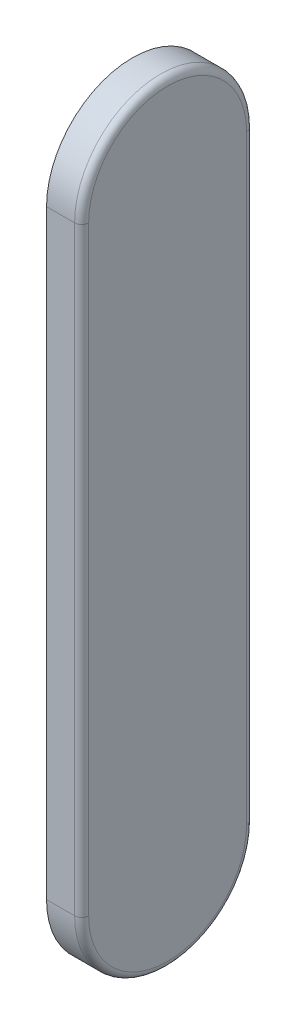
ISO-10303-21;
HEADER;
FILE_DESCRIPTION(('STEP AP214'),'2;1');
FILE_NAME('part.step','',(''),(''),'','','');
FILE_SCHEMA(('AUTOMOTIVE_DESIGN { 1 0 10303 214 1 1 1 1 }'));
ENDSEC;
DATA;
#1=APPLICATION_CONTEXT('core data for automotive mechanical design processes');
#2=APPLICATION_PROTOCOL_DEFINITION('international standard','automotive_design',2000,#1);
#3=PRODUCT_CONTEXT('',#1,'mechanical');
#4=PRODUCT('Part','Part','',(#3));
#5=PRODUCT_RELATED_PRODUCT_CATEGORY('part','',(#4));
#6=PRODUCT_DEFINITION_FORMATION('','',#4);
#7=PRODUCT_DEFINITION_CONTEXT('part definition',#1,'design');
#8=PRODUCT_DEFINITION('design','',#6,#7);
#9=PRODUCT_DEFINITION_SHAPE('','',#8);
#10=(LENGTH_UNIT() NAMED_UNIT(*) SI_UNIT(.MILLI.,.METRE.));
#11=(NAMED_UNIT(*) PLANE_ANGLE_UNIT() SI_UNIT($,.RADIAN.));
#12=(NAMED_UNIT(*) SI_UNIT($,.STERADIAN.) SOLID_ANGLE_UNIT());
#13=UNCERTAINTY_MEASURE_WITH_UNIT(LENGTH_MEASURE(1.E-05),#10,'distance_accuracy_value','');
#14=(GEOMETRIC_REPRESENTATION_CONTEXT(3) GLOBAL_UNCERTAINTY_ASSIGNED_CONTEXT((#13)) GLOBAL_UNIT_ASSIGNED_CONTEXT((#10,
#11,#12)) REPRESENTATION_CONTEXT('',''));
#15=CARTESIAN_POINT('',(0.,0.,0.));
#16=DIRECTION('',(0.,0.,1.));
#17=DIRECTION('',(1.,0.,0.));
#18=AXIS2_PLACEMENT_3D('',#15,#16,#17);
#19=CARTESIAN_POINT('',(39.25,23.825,3.99999999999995));
#20=DIRECTION('',(1.,0.,0.));
#21=DIRECTION('',(0.,0.,-1.));
#22=AXIS2_PLACEMENT_3D('',#19,#20,#21);
#23=PLANE('',#22);
#24=CARTESIAN_POINT('',(39.25,23.825,3.99999999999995));
#25=DIRECTION('',(-1.,0.,0.));
#26=DIRECTION('',(0.,0.,1.));
#27=AXIS2_PLACEMENT_3D('',#24,#25,#26);
#28=CIRCLE('',#27,1.125);
#29=CARTESIAN_POINT('',(39.25,23.825,5.12499999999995));
#30=VERTEX_POINT('',#29);
#31=CARTESIAN_POINT('',(39.25,23.825,2.87499999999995));
#32=VERTEX_POINT('',#31);
#33=EDGE_CURVE('E176',#30,#32,#28,.T.);
#34=ORIENTED_EDGE('',*,*,#33,.F.);
#35=DIRECTION('',(0.,1.,0.));
#36=VECTOR('',#35,1.);
#37=CARTESIAN_POINT('',(39.25,23.825,5.12499999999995));
#38=LINE('',#37,#36);
#39=CARTESIAN_POINT('',(39.25,15.275,5.12499999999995));
#40=VERTEX_POINT('',#39);
#41=EDGE_CURVE('E115',#40,#30,#38,.T.);
#42=ORIENTED_EDGE('',*,*,#41,.F.);
#43=CARTESIAN_POINT('',(39.25,15.275,3.99999999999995));
#44=DIRECTION('',(-1.,0.,0.));
#45=DIRECTION('',(0.,0.,-1.));
#46=AXIS2_PLACEMENT_3D('',#43,#44,#45);
#47=CIRCLE('',#46,1.125);
#48=CARTESIAN_POINT('',(39.25,15.275,2.87499999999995));
#49=VERTEX_POINT('',#48);
#50=EDGE_CURVE('E132',#49,#40,#47,.T.);
#51=ORIENTED_EDGE('',*,*,#50,.F.);
#52=DIRECTION('',(0.,-1.,0.));
#53=VECTOR('',#52,1.);
#54=CARTESIAN_POINT('',(39.25,23.825,2.87499999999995));
#55=LINE('',#54,#53);
#56=EDGE_CURVE('E154',#32,#49,#55,.T.);
#57=ORIENTED_EDGE('',*,*,#56,.F.);
#58=EDGE_LOOP('',(#34,#42,#51,#57));
#59=FACE_BOUND('',#58,.T.);
#60=ADVANCED_FACE('F17',(#59),#23,.T.);
#61=CARTESIAN_POINT('',(39.15,23.825,5.12499999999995));
#62=DIRECTION('',(0.,1.,0.));
#63=DIRECTION('',(0.,0.,1.));
#64=AXIS2_PLACEMENT_3D('',#61,#62,#63);
#65=CYLINDRICAL_SURFACE('',#64,0.1);
#66=CARTESIAN_POINT('',(39.15,15.275,5.12499999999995));
#67=DIRECTION('',(0.,-1.,0.));
#68=DIRECTION('',(0.,0.,1.));
#69=AXIS2_PLACEMENT_3D('',#66,#67,#68);
#70=CIRCLE('',#69,0.1);
#71=CARTESIAN_POINT('',(39.15,15.275,5.22499999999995));
#72=VERTEX_POINT('',#71);
#73=EDGE_CURVE('E123',#40,#72,#70,.T.);
#74=ORIENTED_EDGE('',*,*,#73,.F.);
#75=ORIENTED_EDGE('',*,*,#41,.T.);
#76=CARTESIAN_POINT('',(39.15,23.825,5.12499999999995));
#77=DIRECTION('',(0.,-1.,0.));
#78=DIRECTION('',(0.,0.,1.));
#79=AXIS2_PLACEMENT_3D('',#76,#77,#78);
#80=CIRCLE('',#79,0.1);
#81=CARTESIAN_POINT('',(39.15,23.825,5.22499999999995));
#82=VERTEX_POINT('',#81);
#83=EDGE_CURVE('E157',#82,#30,#80,.F.);
#84=ORIENTED_EDGE('',*,*,#83,.F.);
#85=DIRECTION('',(0.,1.,0.));
#86=VECTOR('',#85,1.);
#87=CARTESIAN_POINT('',(39.15,23.825,5.22499999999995));
#88=LINE('',#87,#86);
#89=EDGE_CURVE('E188',#82,#72,#88,.F.);
#90=ORIENTED_EDGE('',*,*,#89,.T.);
#91=EDGE_LOOP('',(#74,#75,#84,#90));
#92=FACE_BOUND('',#91,.T.);
#93=ADVANCED_FACE('F145',(#92),#65,.T.);
#94=CARTESIAN_POINT('',(39.15,15.275,3.99999999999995));
#95=DIRECTION('',(1.,0.,0.));
#96=DIRECTION('',(0.,0.,-1.));
#97=AXIS2_PLACEMENT_3D('',#94,#95,#96);
#98=TOROIDAL_SURFACE('',#97,1.125,0.1);
#99=CARTESIAN_POINT('',(39.15,15.275,2.87499999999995));
#100=DIRECTION('',(0.,-1.,0.));
#101=DIRECTION('',(0.,0.,-1.));
#102=AXIS2_PLACEMENT_3D('',#99,#100,#101);
#103=CIRCLE('',#102,0.0999999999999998);
#104=CARTESIAN_POINT('',(39.15,15.275,2.77499999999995));
#105=VERTEX_POINT('',#104);
#106=EDGE_CURVE('E158',#49,#105,#103,.F.);
#107=ORIENTED_EDGE('',*,*,#106,.F.);
#108=ORIENTED_EDGE('',*,*,#50,.T.);
#109=ORIENTED_EDGE('',*,*,#73,.T.);
#110=CARTESIAN_POINT('',(39.15,15.275,3.99999999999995));
#111=DIRECTION('',(-1.,0.,0.));
#112=DIRECTION('',(0.,0.,1.));
#113=AXIS2_PLACEMENT_3D('',#110,#111,#112);
#114=CIRCLE('',#113,1.225);
#115=EDGE_CURVE('E55',#105,#72,#114,.T.);
#116=ORIENTED_EDGE('',*,*,#115,.F.);
#117=EDGE_LOOP('',(#107,#108,#109,#116));
#118=FACE_BOUND('',#117,.T.);
#119=ADVANCED_FACE('F136',(#118),#98,.T.);
#120=CARTESIAN_POINT('',(39.15,23.825,2.87499999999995));
#121=DIRECTION('',(0.,-1.,0.));
#122=DIRECTION('',(0.,0.,-1.));
#123=AXIS2_PLACEMENT_3D('',#120,#121,#122);
#124=CYLINDRICAL_SURFACE('',#123,0.0999999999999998);
#125=CARTESIAN_POINT('',(39.15,23.825,2.87499999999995));
#126=DIRECTION('',(0.,1.,0.));
#127=DIRECTION('',(0.,0.,-1.));
#128=AXIS2_PLACEMENT_3D('',#125,#126,#127);
#129=CIRCLE('',#128,0.1);
#130=CARTESIAN_POINT('',(39.15,23.825,2.77499999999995));
#131=VERTEX_POINT('',#130);
#132=EDGE_CURVE('E96',#32,#131,#129,.T.);
#133=ORIENTED_EDGE('',*,*,#132,.F.);
#134=ORIENTED_EDGE('',*,*,#56,.T.);
#135=ORIENTED_EDGE('',*,*,#106,.T.);
#136=DIRECTION('',(0.,-1.,0.));
#137=VECTOR('',#136,1.);
#138=CARTESIAN_POINT('',(39.15,15.275,2.77499999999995));
#139=LINE('',#138,#137);
#140=EDGE_CURVE('E79',#105,#131,#139,.F.);
#141=ORIENTED_EDGE('',*,*,#140,.T.);
#142=EDGE_LOOP('',(#133,#134,#135,#141));
#143=FACE_BOUND('',#142,.T.);
#144=ADVANCED_FACE('F104',(#143),#124,.T.);
#145=CARTESIAN_POINT('',(39.15,23.825,3.99999999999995));
#146=DIRECTION('',(1.,0.,0.));
#147=DIRECTION('',(0.,0.,-1.));
#148=AXIS2_PLACEMENT_3D('',#145,#146,#147);
#149=TOROIDAL_SURFACE('',#148,1.125,0.1);
#150=ORIENTED_EDGE('',*,*,#132,.T.);
#151=CARTESIAN_POINT('',(39.15,23.825,3.99999999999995));
#152=DIRECTION('',(-1.,0.,0.));
#153=DIRECTION('',(0.,0.,1.));
#154=AXIS2_PLACEMENT_3D('',#151,#152,#153);
#155=CIRCLE('',#154,1.225);
#156=EDGE_CURVE('E72',#82,#131,#155,.T.);
#157=ORIENTED_EDGE('',*,*,#156,.F.);
#158=ORIENTED_EDGE('',*,*,#83,.T.);
#159=ORIENTED_EDGE('',*,*,#33,.T.);
#160=EDGE_LOOP('',(#150,#157,#158,#159));
#161=FACE_BOUND('',#160,.T.);
#162=ADVANCED_FACE('F99',(#161),#149,.T.);
#163=CARTESIAN_POINT('',(39.25,23.825,5.22499999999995));
#164=DIRECTION('',(0.,0.,-1.));
#165=DIRECTION('',(-1.,0.,0.));
#166=AXIS2_PLACEMENT_3D('',#163,#164,#165);
#167=PLANE('',#166);
#168=ORIENTED_EDGE('',*,*,#89,.F.);
#169=DIRECTION('',(-1.,0.,0.));
#170=VECTOR('',#169,1.);
#171=CARTESIAN_POINT('',(39.25,23.825,5.22499999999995));
#172=LINE('',#171,#170);
#173=CARTESIAN_POINT('',(38.75,23.825,5.22499999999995));
#174=VERTEX_POINT('',#173);
#175=EDGE_CURVE('E70',#174,#82,#172,.F.);
#176=ORIENTED_EDGE('',*,*,#175,.F.);
#177=DIRECTION('',(0.,1.,0.));
#178=VECTOR('',#177,1.);
#179=CARTESIAN_POINT('',(38.75,23.825,5.22499999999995));
#180=LINE('',#179,#178);
#181=CARTESIAN_POINT('',(38.75,15.275,5.22499999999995));
#182=VERTEX_POINT('',#181);
#183=EDGE_CURVE('E65',#174,#182,#180,.F.);
#184=ORIENTED_EDGE('',*,*,#183,.T.);
#185=DIRECTION('',(-1.,0.,0.));
#186=VECTOR('',#185,1.);
#187=CARTESIAN_POINT('',(39.25,15.275,5.22499999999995));
#188=LINE('',#187,#186);
#189=EDGE_CURVE('E49',#72,#182,#188,.T.);
#190=ORIENTED_EDGE('',*,*,#189,.F.);
#191=EDGE_LOOP('',(#168,#176,#184,#190));
#192=FACE_BOUND('',#191,.T.);
#193=ADVANCED_FACE('F68',(#192),#167,.F.);
#194=CARTESIAN_POINT('',(39.25,15.275,3.99999999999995));
#195=DIRECTION('',(-1.,0.,0.));
#196=DIRECTION('',(0.,0.,1.));
#197=AXIS2_PLACEMENT_3D('',#194,#195,#196);
#198=CYLINDRICAL_SURFACE('',#197,1.225);
#199=ORIENTED_EDGE('',*,*,#189,.T.);
#200=CARTESIAN_POINT('',(38.75,15.275,3.99999999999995));
#201=DIRECTION('',(-1.,0.,0.));
#202=DIRECTION('',(0.,0.,1.));
#203=AXIS2_PLACEMENT_3D('',#200,#201,#202);
#204=CIRCLE('',#203,1.225);
#205=CARTESIAN_POINT('',(38.75,15.275,2.77499999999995));
#206=VERTEX_POINT('',#205);
#207=EDGE_CURVE('E21',#182,#206,#204,.F.);
#208=ORIENTED_EDGE('',*,*,#207,.T.);
#209=DIRECTION('',(1.,0.,0.));
#210=VECTOR('',#209,1.);
#211=CARTESIAN_POINT('',(39.25,15.275,2.77499999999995));
#212=LINE('',#211,#210);
#213=EDGE_CURVE('E60',#206,#105,#212,.T.);
#214=ORIENTED_EDGE('',*,*,#213,.T.);
#215=ORIENTED_EDGE('',*,*,#115,.T.);
#216=EDGE_LOOP('',(#199,#208,#214,#215));
#217=FACE_BOUND('',#216,.T.);
#218=ADVANCED_FACE('F51',(#217),#198,.T.);
#219=CARTESIAN_POINT('',(39.25,15.275,2.77499999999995));
#220=DIRECTION('',(0.,0.,1.));
#221=DIRECTION('',(0.,-1.,0.));
#222=AXIS2_PLACEMENT_3D('',#219,#220,#221);
#223=PLANE('',#222);
#224=ORIENTED_EDGE('',*,*,#140,.F.);
#225=ORIENTED_EDGE('',*,*,#213,.F.);
#226=DIRECTION('',(0.,1.,0.));
#227=VECTOR('',#226,1.);
#228=CARTESIAN_POINT('',(38.75,23.825,2.77499999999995));
#229=LINE('',#228,#227);
#230=CARTESIAN_POINT('',(38.75,23.825,2.77499999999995));
#231=VERTEX_POINT('',#230);
#232=EDGE_CURVE('E27',#206,#231,#229,.T.);
#233=ORIENTED_EDGE('',*,*,#232,.T.);
#234=DIRECTION('',(-1.,0.,0.));
#235=VECTOR('',#234,1.);
#236=CARTESIAN_POINT('',(39.25,23.825,2.77499999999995));
#237=LINE('',#236,#235);
#238=EDGE_CURVE('E33',#131,#231,#237,.T.);
#239=ORIENTED_EDGE('',*,*,#238,.F.);
#240=EDGE_LOOP('',(#224,#225,#233,#239));
#241=FACE_BOUND('',#240,.T.);
#242=ADVANCED_FACE('F208',(#241),#223,.F.);
#243=CARTESIAN_POINT('',(39.25,23.825,3.99999999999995));
#244=DIRECTION('',(-1.,0.,0.));
#245=DIRECTION('',(0.,0.,1.));
#246=AXIS2_PLACEMENT_3D('',#243,#244,#245);
#247=CYLINDRICAL_SURFACE('',#246,1.225);
#248=ORIENTED_EDGE('',*,*,#238,.T.);
#249=CARTESIAN_POINT('',(38.75,23.825,3.99999999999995));
#250=DIRECTION('',(-1.,0.,0.));
#251=DIRECTION('',(0.,0.,1.));
#252=AXIS2_PLACEMENT_3D('',#249,#250,#251);
#253=CIRCLE('',#252,1.225);
#254=EDGE_CURVE('E11',#231,#174,#253,.F.);
#255=ORIENTED_EDGE('',*,*,#254,.T.);
#256=ORIENTED_EDGE('',*,*,#175,.T.);
#257=ORIENTED_EDGE('',*,*,#156,.T.);
#258=EDGE_LOOP('',(#248,#255,#256,#257));
#259=FACE_BOUND('',#258,.T.);
#260=ADVANCED_FACE('F215',(#259),#247,.T.);
#261=CARTESIAN_POINT('',(38.75,23.825,3.99999999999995));
#262=DIRECTION('',(1.,0.,0.));
#263=DIRECTION('',(0.,0.,-1.));
#264=AXIS2_PLACEMENT_3D('',#261,#262,#263);
#265=PLANE('',#264);
#266=ORIENTED_EDGE('',*,*,#232,.F.);
#267=ORIENTED_EDGE('',*,*,#207,.F.);
#268=ORIENTED_EDGE('',*,*,#183,.F.);
#269=ORIENTED_EDGE('',*,*,#254,.F.);
#270=EDGE_LOOP('',(#266,#267,#268,#269));
#271=FACE_BOUND('',#270,.T.);
#272=ADVANCED_FACE('F64',(#271),#265,.F.);
#273=CLOSED_SHELL('',(#60,#93,#119,#144,#162,#193,#218,#242,#260,#272));
#274=MANIFOLD_SOLID_BREP('B1',#273);
#275=ADVANCED_BREP_SHAPE_REPRESENTATION('',(#18,#274),#14);
#276=SHAPE_DEFINITION_REPRESENTATION(#9,#275);
ENDSEC;
END-ISO-10303-21;
